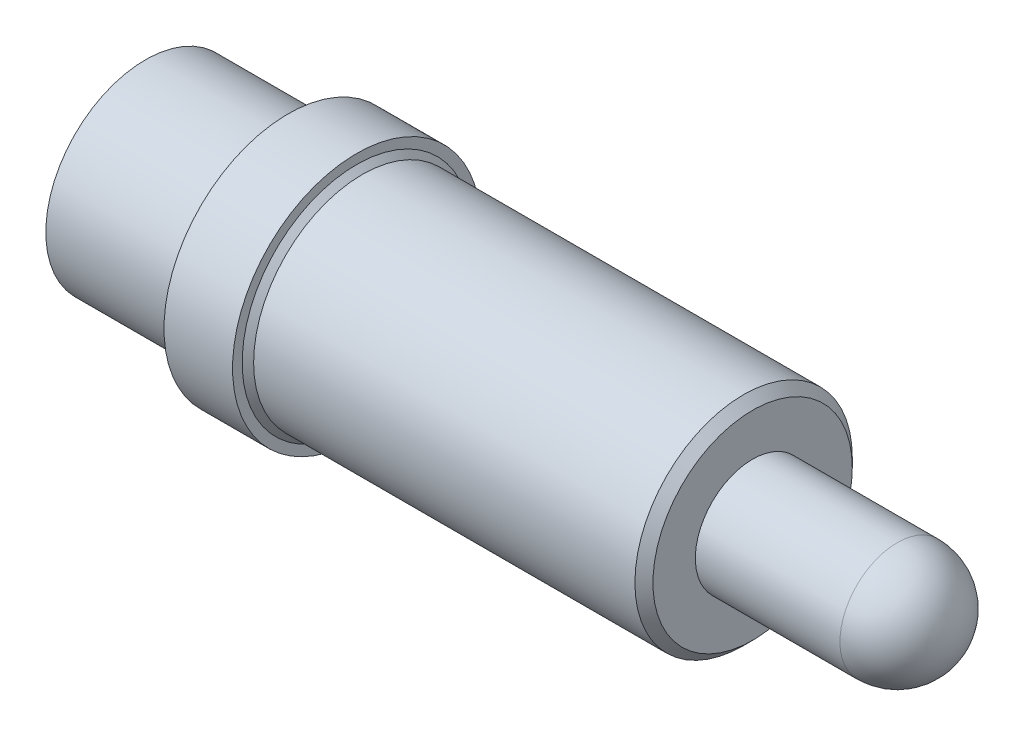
ISO-10303-21;
HEADER;
FILE_DESCRIPTION(('STEP AP214'),'2;1');
FILE_NAME('part.step','',(''),(''),'','','');
FILE_SCHEMA(('AUTOMOTIVE_DESIGN { 1 0 10303 214 1 1 1 1 }'));
ENDSEC;
DATA;
#1=APPLICATION_CONTEXT('core data for automotive mechanical design processes');
#2=APPLICATION_PROTOCOL_DEFINITION('international standard','automotive_design',2000,#1);
#3=PRODUCT_CONTEXT('',#1,'mechanical');
#4=PRODUCT('Part','Part','',(#3));
#5=PRODUCT_RELATED_PRODUCT_CATEGORY('part','',(#4));
#6=PRODUCT_DEFINITION_FORMATION('','',#4);
#7=PRODUCT_DEFINITION_CONTEXT('part definition',#1,'design');
#8=PRODUCT_DEFINITION('design','',#6,#7);
#9=PRODUCT_DEFINITION_SHAPE('','',#8);
#10=(LENGTH_UNIT() NAMED_UNIT(*) SI_UNIT(.MILLI.,.METRE.));
#11=(NAMED_UNIT(*) PLANE_ANGLE_UNIT() SI_UNIT($,.RADIAN.));
#12=(NAMED_UNIT(*) SI_UNIT($,.STERADIAN.) SOLID_ANGLE_UNIT());
#13=UNCERTAINTY_MEASURE_WITH_UNIT(LENGTH_MEASURE(1.E-05),#10,'distance_accuracy_value','');
#14=(GEOMETRIC_REPRESENTATION_CONTEXT(3) GLOBAL_UNCERTAINTY_ASSIGNED_CONTEXT((#13)) GLOBAL_UNIT_ASSIGNED_CONTEXT((#10,
#11,#12)) REPRESENTATION_CONTEXT('',''));
#15=CARTESIAN_POINT('',(0.,0.,0.));
#16=DIRECTION('',(0.,0.,1.));
#17=DIRECTION('',(1.,0.,0.));
#18=AXIS2_PLACEMENT_3D('',#15,#16,#17);
#19=CARTESIAN_POINT('',(0.,0.,0.));
#20=DIRECTION('',(-1.,0.,0.));
#21=DIRECTION('',(0.,0.,1.));
#22=AXIS2_PLACEMENT_3D('',#19,#20,#21);
#23=PLANE('',#22);
#24=CARTESIAN_POINT('',(0.,0.,0.));
#25=DIRECTION('',(1.,0.,0.));
#26=DIRECTION('',(0.,0.,-1.));
#27=AXIS2_PLACEMENT_3D('',#24,#25,#26);
#28=CIRCLE('',#27,1.105);
#29=CARTESIAN_POINT('',(0.,0.,-1.105));
#30=VERTEX_POINT('',#29);
#31=EDGE_CURVE('E60',#30,#30,#28,.T.);
#32=ORIENTED_EDGE('',*,*,#31,.F.);
#33=EDGE_LOOP('',(#32));
#34=FACE_BOUND('',#33,.T.);
#35=ADVANCED_FACE('F36',(#34),#23,.T.);
#36=CARTESIAN_POINT('',(0.,0.,0.));
#37=DIRECTION('',(1.,0.,0.));
#38=DIRECTION('',(0.,0.,-1.));
#39=AXIS2_PLACEMENT_3D('',#36,#37,#38);
#40=CYLINDRICAL_SURFACE('',#39,1.105);
#41=ORIENTED_EDGE('',*,*,#31,.T.);
#42=EDGE_LOOP('',(#41));
#43=FACE_BOUND('',#42,.T.);
#44=CARTESIAN_POINT('',(1.58,0.,0.));
#45=DIRECTION('',(1.,0.,0.));
#46=DIRECTION('',(0.,0.,-1.));
#47=AXIS2_PLACEMENT_3D('',#44,#45,#46);
#48=CIRCLE('',#47,1.105);
#49=CARTESIAN_POINT('',(1.58,0.,-1.105));
#50=VERTEX_POINT('',#49);
#51=EDGE_CURVE('E64',#50,#50,#48,.T.);
#52=ORIENTED_EDGE('',*,*,#51,.F.);
#53=EDGE_LOOP('',(#52));
#54=FACE_BOUND('',#53,.T.);
#55=ADVANCED_FACE('F101',(#43,#54),#40,.T.);
#56=CARTESIAN_POINT('',(1.58,1.105,0.));
#57=DIRECTION('',(-1.,0.,0.));
#58=DIRECTION('',(0.,0.,1.));
#59=AXIS2_PLACEMENT_3D('',#56,#57,#58);
#60=PLANE('',#59);
#61=ORIENTED_EDGE('',*,*,#51,.T.);
#62=EDGE_LOOP('',(#61));
#63=FACE_BOUND('',#62,.T.);
#64=CARTESIAN_POINT('',(1.58,0.,0.));
#65=DIRECTION('',(1.,0.,0.));
#66=DIRECTION('',(0.,0.,-1.));
#67=AXIS2_PLACEMENT_3D('',#64,#65,#66);
#68=CIRCLE('',#67,1.375);
#69=CARTESIAN_POINT('',(1.58,0.,-1.375));
#70=VERTEX_POINT('',#69);
#71=EDGE_CURVE('E68',#70,#70,#68,.T.);
#72=ORIENTED_EDGE('',*,*,#71,.F.);
#73=EDGE_LOOP('',(#72));
#74=FACE_BOUND('',#73,.T.);
#75=ADVANCED_FACE('F107',(#63,#74),#60,.T.);
#76=CARTESIAN_POINT('',(0.,0.,0.));
#77=DIRECTION('',(1.,0.,0.));
#78=DIRECTION('',(0.,0.,-1.));
#79=AXIS2_PLACEMENT_3D('',#76,#77,#78);
#80=CYLINDRICAL_SURFACE('',#79,1.375);
#81=ORIENTED_EDGE('',*,*,#71,.T.);
#82=EDGE_LOOP('',(#81));
#83=FACE_BOUND('',#82,.T.);
#84=CARTESIAN_POINT('',(2.34,0.,0.));
#85=DIRECTION('',(1.,0.,0.));
#86=DIRECTION('',(0.,0.,-1.));
#87=AXIS2_PLACEMENT_3D('',#84,#85,#86);
#88=CIRCLE('',#87,1.375);
#89=CARTESIAN_POINT('',(2.34,0.,-1.375));
#90=VERTEX_POINT('',#89);
#91=EDGE_CURVE('E72',#90,#90,#88,.T.);
#92=ORIENTED_EDGE('',*,*,#91,.F.);
#93=EDGE_LOOP('',(#92));
#94=FACE_BOUND('',#93,.T.);
#95=ADVANCED_FACE('F128',(#83,#94),#80,.T.);
#96=CARTESIAN_POINT('',(2.34,1.375,0.));
#97=DIRECTION('',(1.,0.,0.));
#98=DIRECTION('',(0.,0.,-1.));
#99=AXIS2_PLACEMENT_3D('',#96,#97,#98);
#100=PLANE('',#99);
#101=CARTESIAN_POINT('',(2.34,0.,0.));
#102=DIRECTION('',(1.,0.,0.));
#103=DIRECTION('',(0.,0.,-1.));
#104=AXIS2_PLACEMENT_3D('',#101,#102,#103);
#105=CIRCLE('',#104,1.2685);
#106=CARTESIAN_POINT('',(2.34,0.,-1.2685));
#107=VERTEX_POINT('',#106);
#108=EDGE_CURVE('E49',#107,#107,#105,.F.);
#109=ORIENTED_EDGE('',*,*,#108,.T.);
#110=EDGE_LOOP('',(#109));
#111=FACE_BOUND('',#110,.T.);
#112=ORIENTED_EDGE('',*,*,#91,.T.);
#113=EDGE_LOOP('',(#112));
#114=FACE_BOUND('',#113,.T.);
#115=ADVANCED_FACE('F123',(#111,#114),#100,.T.);
#116=CARTESIAN_POINT('',(0.,0.,0.));
#117=DIRECTION('',(1.,0.,0.));
#118=DIRECTION('',(0.,0.,-1.));
#119=AXIS2_PLACEMENT_3D('',#116,#117,#118);
#120=CYLINDRICAL_SURFACE('',#119,1.205);
#121=CARTESIAN_POINT('',(6.63,0.,0.));
#122=DIRECTION('',(1.,0.,0.));
#123=DIRECTION('',(0.,0.,-1.));
#124=AXIS2_PLACEMENT_3D('',#121,#122,#123);
#125=CIRCLE('',#124,1.205);
#126=CARTESIAN_POINT('',(6.63,0.,-1.205));
#127=VERTEX_POINT('',#126);
#128=EDGE_CURVE('E10',#127,#127,#125,.F.);
#129=ORIENTED_EDGE('',*,*,#128,.T.);
#130=EDGE_LOOP('',(#129));
#131=FACE_BOUND('',#130,.T.);
#132=CARTESIAN_POINT('',(2.4035,0.,0.));
#133=DIRECTION('',(1.,0.,0.));
#134=DIRECTION('',(0.,0.,-1.));
#135=AXIS2_PLACEMENT_3D('',#132,#133,#134);
#136=CIRCLE('',#135,1.205);
#137=CARTESIAN_POINT('',(2.4035,0.,-1.205));
#138=VERTEX_POINT('',#137);
#139=EDGE_CURVE('E55',#138,#138,#136,.T.);
#140=ORIENTED_EDGE('',*,*,#139,.T.);
#141=EDGE_LOOP('',(#140));
#142=FACE_BOUND('',#141,.T.);
#143=ADVANCED_FACE('F98',(#131,#142),#120,.T.);
#144=CARTESIAN_POINT('',(6.73,1.205,0.));
#145=DIRECTION('',(1.,0.,0.));
#146=DIRECTION('',(0.,0.,-1.));
#147=AXIS2_PLACEMENT_3D('',#144,#145,#146);
#148=PLANE('',#147);
#149=CARTESIAN_POINT('',(6.73,0.,0.));
#150=DIRECTION('',(1.,0.,0.));
#151=DIRECTION('',(0.,0.,-1.));
#152=AXIS2_PLACEMENT_3D('',#149,#150,#151);
#153=CIRCLE('',#152,1.105);
#154=CARTESIAN_POINT('',(6.73,0.,-1.105));
#155=VERTEX_POINT('',#154);
#156=EDGE_CURVE('E44',#155,#155,#153,.T.);
#157=ORIENTED_EDGE('',*,*,#156,.T.);
#158=EDGE_LOOP('',(#157));
#159=FACE_BOUND('',#158,.T.);
#160=CARTESIAN_POINT('',(6.73,0.,0.));
#161=DIRECTION('',(1.,0.,0.));
#162=DIRECTION('',(0.,0.,-1.));
#163=AXIS2_PLACEMENT_3D('',#160,#161,#162);
#164=CIRCLE('',#163,0.635000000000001);
#165=CARTESIAN_POINT('',(6.73,0.,-0.635000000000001));
#166=VERTEX_POINT('',#165);
#167=EDGE_CURVE('E76',#166,#166,#164,.T.);
#168=ORIENTED_EDGE('',*,*,#167,.F.);
#169=EDGE_LOOP('',(#168));
#170=FACE_BOUND('',#169,.T.);
#171=ADVANCED_FACE('F89',(#159,#170),#148,.T.);
#172=CARTESIAN_POINT('',(0.,0.,0.));
#173=DIRECTION('',(1.,0.,0.));
#174=DIRECTION('',(0.,0.,-1.));
#175=AXIS2_PLACEMENT_3D('',#172,#173,#174);
#176=CYLINDRICAL_SURFACE('',#175,0.635000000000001);
#177=ORIENTED_EDGE('',*,*,#167,.T.);
#178=EDGE_LOOP('',(#177));
#179=FACE_BOUND('',#178,.T.);
#180=CARTESIAN_POINT('',(8.333000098,0.,0.));
#181=DIRECTION('',(1.,0.,0.));
#182=DIRECTION('',(0.,0.,-1.));
#183=AXIS2_PLACEMENT_3D('',#180,#181,#182);
#184=CIRCLE('',#183,0.635000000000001);
#185=CARTESIAN_POINT('',(8.333000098,0.,-0.635000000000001));
#186=VERTEX_POINT('',#185);
#187=EDGE_CURVE('E80',#186,#186,#184,.T.);
#188=ORIENTED_EDGE('',*,*,#187,.F.);
#189=EDGE_LOOP('',(#188));
#190=FACE_BOUND('',#189,.T.);
#191=ADVANCED_FACE('F87',(#179,#190),#176,.T.);
#192=CARTESIAN_POINT('',(8.333000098,0.,0.));
#193=DIRECTION('',(1.,0.,0.));
#194=DIRECTION('',(0.,1.,0.));
#195=AXIS2_PLACEMENT_3D('',#192,#193,#194);
#196=SPHERICAL_SURFACE('',#195,0.635);
#197=ORIENTED_EDGE('',*,*,#187,.T.);
#198=EDGE_LOOP('',(#197));
#199=FACE_BOUND('',#198,.T.);
#200=ADVANCED_FACE('F85',(#199),#196,.T.);
#201=CARTESIAN_POINT('',(2.4035,0.,0.));
#202=DIRECTION('',(-1.,0.,0.));
#203=DIRECTION('',(0.,0.,1.));
#204=AXIS2_PLACEMENT_3D('',#201,#202,#203);
#205=CONICAL_SURFACE('',#204,1.205,0.785398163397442);
#206=ORIENTED_EDGE('',*,*,#108,.F.);
#207=EDGE_LOOP('',(#206));
#208=FACE_BOUND('',#207,.T.);
#209=ORIENTED_EDGE('',*,*,#139,.F.);
#210=EDGE_LOOP('',(#209));
#211=FACE_BOUND('',#210,.T.);
#212=ADVANCED_FACE('F96',(#208,#211),#205,.T.);
#213=CARTESIAN_POINT('',(6.73,0.,0.));
#214=DIRECTION('',(-1.,0.,0.));
#215=DIRECTION('',(0.,0.,1.));
#216=AXIS2_PLACEMENT_3D('',#213,#214,#215);
#217=CONICAL_SURFACE('',#216,1.105,0.785398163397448);
#218=ORIENTED_EDGE('',*,*,#128,.F.);
#219=EDGE_LOOP('',(#218));
#220=FACE_BOUND('',#219,.T.);
#221=ORIENTED_EDGE('',*,*,#156,.F.);
#222=EDGE_LOOP('',(#221));
#223=FACE_BOUND('',#222,.T.);
#224=ADVANCED_FACE('F38',(#220,#223),#217,.T.);
#225=CLOSED_SHELL('',(#35,#55,#75,#95,#115,#143,#171,#191,#200,#212,#224));
#226=MANIFOLD_SOLID_BREP('B2',#225);
#227=ADVANCED_BREP_SHAPE_REPRESENTATION('',(#18,#226),#14);
#228=SHAPE_DEFINITION_REPRESENTATION(#9,#227);
ENDSEC;
END-ISO-10303-21;
